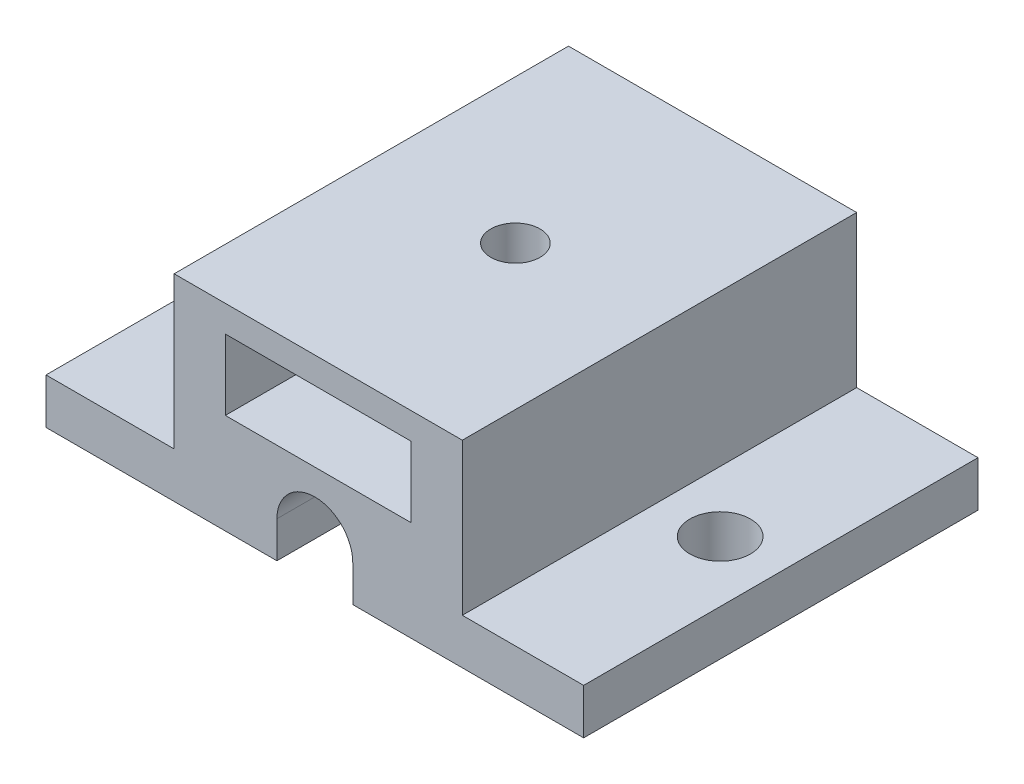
from build123d import *

# Parameters (mm, degrees)
BOSS_EXTRUDE1_DEPTH = 26
SKETCH2_R           = 2
CUT_EXTRUDE1_DEPTH  = 20
CUT_EXTRUDE2_DEPTH  = 46.84302394
SKETCH6_R           = 1.625
CUT_EXTRUDE3_DEPTH  = 46.84302394
SKETCH7_W           = 12.25
SKETCH7_H           = 4.65
CUT_EXTRUDE4_DEPTH  = 10


with BuildPart() as part:
    # Sketch1 → Boss-Extrude1 (new body)
    with BuildSketch(Plane.XY):
        Polygon((35.448312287, 0), (35.448312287, 3), (27.448312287, 3), (27.448312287, 13), (8.448312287, 13), (8.448312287, 3), (0, 3), (0, 0), align=None)
    extrude(amount=BOSS_EXTRUDE1_DEPTH)

    # Sketch2 → Cut-Extrude1 (cut)
    with BuildSketch(Plane(origin=(0, 3, 0), x_dir=(1, 0, 0), z_dir=(0, 1, 0))):
        with Locations(Location((4, -13, 0), (0, 0, 270))):
            Circle(SKETCH2_R)
        with Locations(Location((31.448312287, -13, 0), (0, 0, 270))):
            Circle(SKETCH2_R)
    extrude(amount=-CUT_EXTRUDE1_DEPTH, mode=Mode.SUBTRACT)

    # Sketch4 → Cut-Extrude2 (cut, through all)
    with BuildSketch(Plane(origin=(0, 0, 0), x_dir=(-1, 0, 0), z_dir=(0, 0, -1))):
        with BuildLine():
            Line((-20.225, 2.4), (-20.225, 0))
            Line((-20.225, 0), (-15.225, 0))
            Line((-15.225, 0), (-15.225, 2.4))
            ThreePointArc((-15.225, 2.4), (-17.725, 4.9), (-20.225, 2.4))
        make_face()
    extrude(amount=-CUT_EXTRUDE2_DEPTH, mode=Mode.SUBTRACT)

    # Sketch6 → Cut-Extrude3 (cut, through all)
    with BuildSketch(Plane(origin=(0, 13, 0), x_dir=(1, 0, 0), z_dir=(0, 1, 0))):
        with Locations(Location((17.948312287, -13, 0), (0, 0, 270))):
            Circle(SKETCH6_R)
    extrude(amount=-CUT_EXTRUDE3_DEPTH, mode=Mode.SUBTRACT)

    # Sketch7 → Cut-Extrude4 (cut)
    with BuildSketch(Plane.XY.offset(26)):
        with Locations((17.948312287, 8.925)):
            Rectangle(SKETCH7_W, SKETCH7_H)
    extrude(amount=-CUT_EXTRUDE4_DEPTH, mode=Mode.SUBTRACT)


solid = part.part
